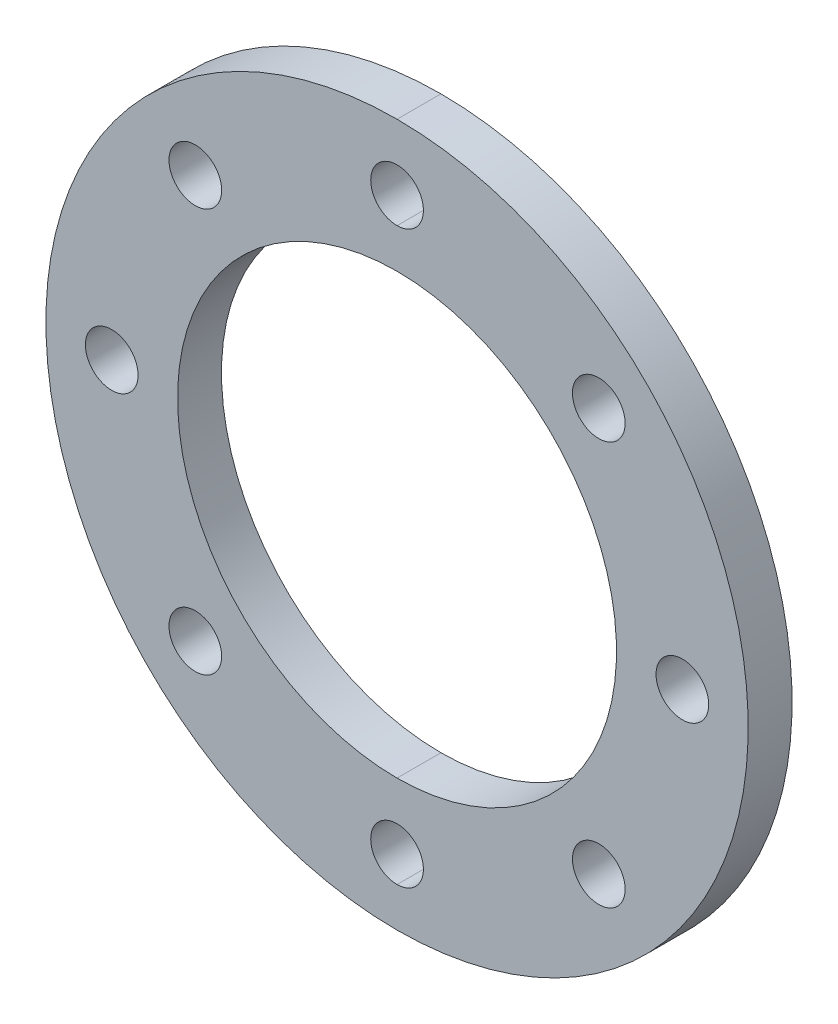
from build123d import *

# Parameters (mm, degrees)
SKETCH1_R         = 40
EXTRUDE1_DEPTH    = 5
SKETCH2_R         = 25
EXTRUDE2_DEPTH    = 57.789083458
SKETCH3_R         = 3
EXTRUDE3_DEPTH    = 57.789083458
CIRPATTERN1_COUNT = 8


with BuildPart() as part:
    # Sketch1 → Extrude1 (new body)
    with BuildSketch(Plane.XY):
        Circle(SKETCH1_R)
    extrude(amount=EXTRUDE1_DEPTH)

    # Sketch2 → Extrude2 (cut, through all)
    with BuildSketch(Plane.XY.offset(5)):
        Circle(SKETCH2_R)
    extrude(amount=-EXTRUDE2_DEPTH, mode=Mode.SUBTRACT)

    # Sketch3 → Extrude3 (cut, through all)
    with BuildSketch(Plane.XY.offset(5)):
        with Locations((32.5, 0)):
            Circle(SKETCH3_R)
    extrude3 = extrude(amount=-EXTRUDE3_DEPTH, mode=Mode.SUBTRACT)

    # CirPattern1: Extrude3 ×8 about axis
    cirpattern1_axis = Axis((0, 0, 0), (0, 0, 1))
    for i in range(1, CIRPATTERN1_COUNT):
        add(extrude3.rotate(cirpattern1_axis, i * 360 / CIRPATTERN1_COUNT), mode=Mode.SUBTRACT)


solid = part.part
